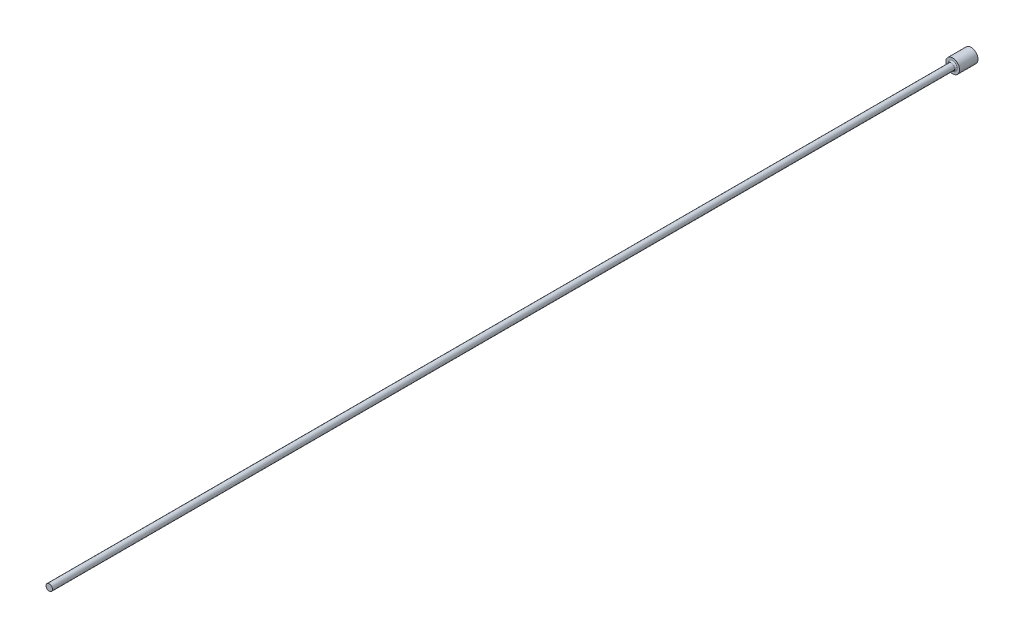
from build123d import *

# Parameters (mm, degrees)
FILLET1_R = 0.3


with BuildPart() as part:
    # FV → Revolve1 (revolve)
    with BuildSketch(Plane(origin=(0, 0, 0), x_dir=(1, 0, 0), z_dir=(0, 1, 0)), mode=Mode.PRIVATE) as revolve1_sk:
        Polygon((0, 0), (1.5, 0), (1.5, -4), (0.7, -4), (0.7, -200), (0, -200), align=None)
    revolve(revolve1_sk.sketch.rotate(Axis((0, 0, -9.033228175), (0, 0, 1)), 180), axis=Axis((0, 0, -9.033228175), (0, 0, 1)))

    # Fillet1
    fillet1_edges = [part.edges().sort_by_distance(p)[0] for p in [
        (0.7, 0, 4),
    ]]
    fillet(fillet1_edges, radius=FILLET1_R)


solid = part.part
